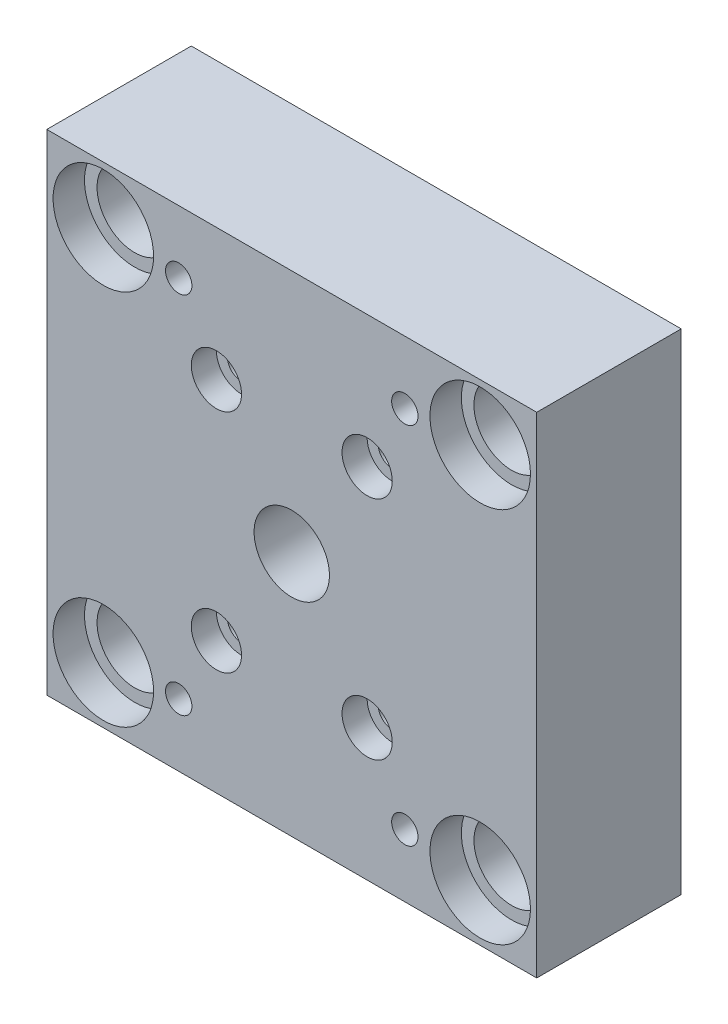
ISO-10303-21;
HEADER;
FILE_DESCRIPTION(('STEP AP214'),'2;1');
FILE_NAME('part.step','',(''),(''),'','','');
FILE_SCHEMA(('AUTOMOTIVE_DESIGN { 1 0 10303 214 1 1 1 1 }'));
ENDSEC;
DATA;
#1=APPLICATION_CONTEXT('core data for automotive mechanical design processes');
#2=APPLICATION_PROTOCOL_DEFINITION('international standard','automotive_design',2000,#1);
#3=PRODUCT_CONTEXT('',#1,'mechanical');
#4=PRODUCT('Part','Part','',(#3));
#5=PRODUCT_RELATED_PRODUCT_CATEGORY('part','',(#4));
#6=PRODUCT_DEFINITION_FORMATION('','',#4);
#7=PRODUCT_DEFINITION_CONTEXT('part definition',#1,'design');
#8=PRODUCT_DEFINITION('design','',#6,#7);
#9=PRODUCT_DEFINITION_SHAPE('','',#8);
#10=(LENGTH_UNIT() NAMED_UNIT(*) SI_UNIT(.MILLI.,.METRE.));
#11=(NAMED_UNIT(*) PLANE_ANGLE_UNIT() SI_UNIT($,.RADIAN.));
#12=(NAMED_UNIT(*) SI_UNIT($,.STERADIAN.) SOLID_ANGLE_UNIT());
#13=UNCERTAINTY_MEASURE_WITH_UNIT(LENGTH_MEASURE(1.E-05),#10,'distance_accuracy_value','');
#14=(GEOMETRIC_REPRESENTATION_CONTEXT(3) GLOBAL_UNCERTAINTY_ASSIGNED_CONTEXT((#13)) GLOBAL_UNIT_ASSIGNED_CONTEXT((#10,
#11,#12)) REPRESENTATION_CONTEXT('',''));
#15=CARTESIAN_POINT('',(0.,0.,0.));
#16=DIRECTION('',(0.,0.,1.));
#17=DIRECTION('',(1.,0.,0.));
#18=AXIS2_PLACEMENT_3D('',#15,#16,#17);
#19=CARTESIAN_POINT('',(30.,-30.,0.));
#20=DIRECTION('',(0.,0.,1.));
#21=DIRECTION('',(1.,0.,0.));
#22=AXIS2_PLACEMENT_3D('',#19,#20,#21);
#23=CYLINDRICAL_SURFACE('',#22,6.);
#24=CARTESIAN_POINT('',(30.,-30.,0.));
#25=DIRECTION('',(0.,0.,1.));
#26=DIRECTION('',(1.,0.,0.));
#27=AXIS2_PLACEMENT_3D('',#24,#25,#26);
#28=CIRCLE('',#27,6.);
#29=CARTESIAN_POINT('',(36.,-30.,0.));
#30=VERTEX_POINT('',#29);
#31=EDGE_CURVE('E283',#30,#30,#28,.T.);
#32=ORIENTED_EDGE('',*,*,#31,.F.);
#33=EDGE_LOOP('',(#32));
#34=FACE_BOUND('',#33,.T.);
#35=CARTESIAN_POINT('',(30.,-30.,18.));
#36=DIRECTION('',(0.,0.,1.));
#37=DIRECTION('',(1.,0.,0.));
#38=AXIS2_PLACEMENT_3D('',#35,#36,#37);
#39=CIRCLE('',#38,6.);
#40=CARTESIAN_POINT('',(36.,-30.,18.));
#41=VERTEX_POINT('',#40);
#42=EDGE_CURVE('E256',#41,#41,#39,.F.);
#43=ORIENTED_EDGE('',*,*,#42,.F.);
#44=EDGE_LOOP('',(#43));
#45=FACE_BOUND('',#44,.T.);
#46=ADVANCED_FACE('F37',(#34,#45),#23,.F.);
#47=CARTESIAN_POINT('',(-30.,-30.,0.));
#48=DIRECTION('',(0.,0.,1.));
#49=DIRECTION('',(1.,0.,0.));
#50=AXIS2_PLACEMENT_3D('',#47,#48,#49);
#51=CYLINDRICAL_SURFACE('',#50,6.);
#52=CARTESIAN_POINT('',(-30.,-30.,0.));
#53=DIRECTION('',(0.,0.,1.));
#54=DIRECTION('',(1.,0.,0.));
#55=AXIS2_PLACEMENT_3D('',#52,#53,#54);
#56=CIRCLE('',#55,6.);
#57=CARTESIAN_POINT('',(-24.,-30.,0.));
#58=VERTEX_POINT('',#57);
#59=EDGE_CURVE('E280',#58,#58,#56,.T.);
#60=ORIENTED_EDGE('',*,*,#59,.F.);
#61=EDGE_LOOP('',(#60));
#62=FACE_BOUND('',#61,.T.);
#63=CARTESIAN_POINT('',(-30.,-30.,18.));
#64=DIRECTION('',(0.,0.,1.));
#65=DIRECTION('',(1.,0.,0.));
#66=AXIS2_PLACEMENT_3D('',#63,#64,#65);
#67=CIRCLE('',#66,6.);
#68=CARTESIAN_POINT('',(-24.,-30.,18.));
#69=VERTEX_POINT('',#68);
#70=EDGE_CURVE('E262',#69,#69,#67,.F.);
#71=ORIENTED_EDGE('',*,*,#70,.F.);
#72=EDGE_LOOP('',(#71));
#73=FACE_BOUND('',#72,.T.);
#74=ADVANCED_FACE('F409',(#62,#73),#51,.F.);
#75=CARTESIAN_POINT('',(-30.,30.,0.));
#76=DIRECTION('',(0.,0.,1.));
#77=DIRECTION('',(1.,0.,0.));
#78=AXIS2_PLACEMENT_3D('',#75,#76,#77);
#79=CYLINDRICAL_SURFACE('',#78,6.);
#80=CARTESIAN_POINT('',(-30.,30.,0.));
#81=DIRECTION('',(0.,0.,1.));
#82=DIRECTION('',(1.,0.,0.));
#83=AXIS2_PLACEMENT_3D('',#80,#81,#82);
#84=CIRCLE('',#83,6.);
#85=CARTESIAN_POINT('',(-24.,30.,0.));
#86=VERTEX_POINT('',#85);
#87=EDGE_CURVE('E289',#86,#86,#84,.T.);
#88=ORIENTED_EDGE('',*,*,#87,.F.);
#89=EDGE_LOOP('',(#88));
#90=FACE_BOUND('',#89,.T.);
#91=CARTESIAN_POINT('',(-30.,30.,18.));
#92=DIRECTION('',(0.,0.,1.));
#93=DIRECTION('',(1.,0.,0.));
#94=AXIS2_PLACEMENT_3D('',#91,#92,#93);
#95=CIRCLE('',#94,6.);
#96=CARTESIAN_POINT('',(-24.,30.,18.));
#97=VERTEX_POINT('',#96);
#98=EDGE_CURVE('E269',#97,#97,#95,.F.);
#99=ORIENTED_EDGE('',*,*,#98,.F.);
#100=EDGE_LOOP('',(#99));
#101=FACE_BOUND('',#100,.T.);
#102=ADVANCED_FACE('F415',(#90,#101),#79,.F.);
#103=CARTESIAN_POINT('',(30.,30.,0.));
#104=DIRECTION('',(0.,0.,1.));
#105=DIRECTION('',(1.,0.,0.));
#106=AXIS2_PLACEMENT_3D('',#103,#104,#105);
#107=CYLINDRICAL_SURFACE('',#106,6.);
#108=CARTESIAN_POINT('',(30.,30.,0.));
#109=DIRECTION('',(0.,0.,1.));
#110=DIRECTION('',(1.,0.,0.));
#111=AXIS2_PLACEMENT_3D('',#108,#109,#110);
#112=CIRCLE('',#111,6.);
#113=CARTESIAN_POINT('',(36.,30.,0.));
#114=VERTEX_POINT('',#113);
#115=EDGE_CURVE('E286',#114,#114,#112,.T.);
#116=ORIENTED_EDGE('',*,*,#115,.F.);
#117=EDGE_LOOP('',(#116));
#118=FACE_BOUND('',#117,.T.);
#119=CARTESIAN_POINT('',(30.,30.,18.));
#120=DIRECTION('',(0.,0.,1.));
#121=DIRECTION('',(1.,0.,0.));
#122=AXIS2_PLACEMENT_3D('',#119,#120,#121);
#123=CIRCLE('',#122,6.);
#124=CARTESIAN_POINT('',(36.,30.,18.));
#125=VERTEX_POINT('',#124);
#126=EDGE_CURVE('E276',#125,#125,#123,.F.);
#127=ORIENTED_EDGE('',*,*,#126,.F.);
#128=EDGE_LOOP('',(#127));
#129=FACE_BOUND('',#128,.T.);
#130=ADVANCED_FACE('F422',(#118,#129),#107,.F.);
#131=CARTESIAN_POINT('',(-39.,39.,23.));
#132=DIRECTION('',(1.,0.,0.));
#133=DIRECTION('',(0.,1.,0.));
#134=AXIS2_PLACEMENT_3D('',#131,#132,#133);
#135=PLANE('',#134);
#136=DIRECTION('',(0.,-1.,0.));
#137=VECTOR('',#136,1.);
#138=CARTESIAN_POINT('',(-39.,39.,0.));
#139=LINE('',#138,#137);
#140=CARTESIAN_POINT('',(-39.,39.,0.));
#141=VERTEX_POINT('',#140);
#142=CARTESIAN_POINT('',(-39.,-39.,0.));
#143=VERTEX_POINT('',#142);
#144=EDGE_CURVE('E292',#141,#143,#139,.T.);
#145=ORIENTED_EDGE('',*,*,#144,.T.);
#146=DIRECTION('',(0.,0.,-1.));
#147=VECTOR('',#146,1.);
#148=CARTESIAN_POINT('',(-39.,-39.,23.));
#149=LINE('',#148,#147);
#150=CARTESIAN_POINT('',(-39.,-39.,23.));
#151=VERTEX_POINT('',#150);
#152=EDGE_CURVE('E11',#151,#143,#149,.T.);
#153=ORIENTED_EDGE('',*,*,#152,.F.);
#154=DIRECTION('',(0.,-1.,0.));
#155=VECTOR('',#154,1.);
#156=CARTESIAN_POINT('',(-39.,39.,23.));
#157=LINE('',#156,#155);
#158=CARTESIAN_POINT('',(-39.,39.,23.));
#159=VERTEX_POINT('',#158);
#160=EDGE_CURVE('E293',#159,#151,#157,.T.);
#161=ORIENTED_EDGE('',*,*,#160,.F.);
#162=DIRECTION('',(0.,0.,-1.));
#163=VECTOR('',#162,1.);
#164=CARTESIAN_POINT('',(-39.,39.,23.));
#165=LINE('',#164,#163);
#166=EDGE_CURVE('E299',#159,#141,#165,.T.);
#167=ORIENTED_EDGE('',*,*,#166,.T.);
#168=EDGE_LOOP('',(#145,#153,#161,#167));
#169=FACE_BOUND('',#168,.T.);
#170=ADVANCED_FACE('F39',(#169),#135,.F.);
#171=CARTESIAN_POINT('',(-39.,-39.,23.));
#172=DIRECTION('',(0.,1.,0.));
#173=DIRECTION('',(-1.,0.,0.));
#174=AXIS2_PLACEMENT_3D('',#171,#172,#173);
#175=PLANE('',#174);
#176=DIRECTION('',(1.,0.,0.));
#177=VECTOR('',#176,1.);
#178=CARTESIAN_POINT('',(-39.,-39.,0.));
#179=LINE('',#178,#177);
#180=CARTESIAN_POINT('',(39.,-39.,0.));
#181=VERTEX_POINT('',#180);
#182=EDGE_CURVE('E302',#143,#181,#179,.T.);
#183=ORIENTED_EDGE('',*,*,#182,.T.);
#184=DIRECTION('',(0.,0.,-1.));
#185=VECTOR('',#184,1.);
#186=CARTESIAN_POINT('',(39.,-39.,23.));
#187=LINE('',#186,#185);
#188=CARTESIAN_POINT('',(39.,-39.,23.));
#189=VERTEX_POINT('',#188);
#190=EDGE_CURVE('E46',#189,#181,#187,.T.);
#191=ORIENTED_EDGE('',*,*,#190,.F.);
#192=DIRECTION('',(1.,0.,0.));
#193=VECTOR('',#192,1.);
#194=CARTESIAN_POINT('',(-39.,-39.,23.));
#195=LINE('',#194,#193);
#196=EDGE_CURVE('E91',#151,#189,#195,.T.);
#197=ORIENTED_EDGE('',*,*,#196,.F.);
#198=ORIENTED_EDGE('',*,*,#152,.T.);
#199=EDGE_LOOP('',(#183,#191,#197,#198));
#200=FACE_BOUND('',#199,.T.);
#201=ADVANCED_FACE('F389',(#200),#175,.F.);
#202=CARTESIAN_POINT('',(39.,39.,23.));
#203=DIRECTION('',(-1.,0.,0.));
#204=DIRECTION('',(0.,-1.,0.));
#205=AXIS2_PLACEMENT_3D('',#202,#203,#204);
#206=PLANE('',#205);
#207=DIRECTION('',(0.,1.,0.));
#208=VECTOR('',#207,1.);
#209=CARTESIAN_POINT('',(39.,39.,0.));
#210=LINE('',#209,#208);
#211=CARTESIAN_POINT('',(39.,39.,0.));
#212=VERTEX_POINT('',#211);
#213=EDGE_CURVE('E304',#181,#212,#210,.T.);
#214=ORIENTED_EDGE('',*,*,#213,.T.);
#215=DIRECTION('',(0.,0.,-1.));
#216=VECTOR('',#215,1.);
#217=CARTESIAN_POINT('',(39.,39.,23.));
#218=LINE('',#217,#216);
#219=CARTESIAN_POINT('',(39.,39.,23.));
#220=VERTEX_POINT('',#219);
#221=EDGE_CURVE('E308',#220,#212,#218,.T.);
#222=ORIENTED_EDGE('',*,*,#221,.F.);
#223=DIRECTION('',(0.,1.,0.));
#224=VECTOR('',#223,1.);
#225=CARTESIAN_POINT('',(39.,39.,23.));
#226=LINE('',#225,#224);
#227=EDGE_CURVE('E296',#189,#220,#226,.T.);
#228=ORIENTED_EDGE('',*,*,#227,.F.);
#229=ORIENTED_EDGE('',*,*,#190,.T.);
#230=EDGE_LOOP('',(#214,#222,#228,#229));
#231=FACE_BOUND('',#230,.T.);
#232=ADVANCED_FACE('F394',(#231),#206,.F.);
#233=CARTESIAN_POINT('',(-39.,39.,23.));
#234=DIRECTION('',(0.,-1.,0.));
#235=DIRECTION('',(1.,0.,0.));
#236=AXIS2_PLACEMENT_3D('',#233,#234,#235);
#237=PLANE('',#236);
#238=DIRECTION('',(-1.,0.,0.));
#239=VECTOR('',#238,1.);
#240=CARTESIAN_POINT('',(-39.,39.,0.));
#241=LINE('',#240,#239);
#242=EDGE_CURVE('E84',#212,#141,#241,.T.);
#243=ORIENTED_EDGE('',*,*,#242,.T.);
#244=ORIENTED_EDGE('',*,*,#166,.F.);
#245=DIRECTION('',(-1.,0.,0.));
#246=VECTOR('',#245,1.);
#247=CARTESIAN_POINT('',(-39.,39.,23.));
#248=LINE('',#247,#246);
#249=EDGE_CURVE('E63',#220,#159,#248,.T.);
#250=ORIENTED_EDGE('',*,*,#249,.F.);
#251=ORIENTED_EDGE('',*,*,#221,.T.);
#252=EDGE_LOOP('',(#243,#244,#250,#251));
#253=FACE_BOUND('',#252,.T.);
#254=ADVANCED_FACE('F365',(#253),#237,.F.);
#255=CARTESIAN_POINT('',(-39.,-39.,23.));
#256=DIRECTION('',(0.,0.,1.));
#257=DIRECTION('',(1.,0.,0.));
#258=AXIS2_PLACEMENT_3D('',#255,#256,#257);
#259=PLANE('',#258);
#260=CARTESIAN_POINT('',(12.,18.,23.));
#261=DIRECTION('',(0.,0.,1.));
#262=DIRECTION('',(1.,0.,0.));
#263=AXIS2_PLACEMENT_3D('',#260,#261,#262);
#264=CIRCLE('',#263,3.99999999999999);
#265=CARTESIAN_POINT('',(16.,18.,23.));
#266=VERTEX_POINT('',#265);
#267=EDGE_CURVE('E584',#266,#266,#264,.T.);
#268=ORIENTED_EDGE('',*,*,#267,.F.);
#269=EDGE_LOOP('',(#268));
#270=FACE_BOUND('',#269,.T.);
#271=CARTESIAN_POINT('',(-12.,18.,23.));
#272=DIRECTION('',(0.,0.,1.));
#273=DIRECTION('',(1.,0.,0.));
#274=AXIS2_PLACEMENT_3D('',#271,#272,#273);
#275=CIRCLE('',#274,3.99999999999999);
#276=CARTESIAN_POINT('',(-8.00000000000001,18.,23.));
#277=VERTEX_POINT('',#276);
#278=EDGE_CURVE('E331',#277,#277,#275,.T.);
#279=ORIENTED_EDGE('',*,*,#278,.F.);
#280=EDGE_LOOP('',(#279));
#281=FACE_BOUND('',#280,.T.);
#282=CARTESIAN_POINT('',(-12.,-18.,23.));
#283=DIRECTION('',(0.,0.,1.));
#284=DIRECTION('',(1.,0.,0.));
#285=AXIS2_PLACEMENT_3D('',#282,#283,#284);
#286=CIRCLE('',#285,3.99999999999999);
#287=CARTESIAN_POINT('',(-8.,-18.,23.));
#288=VERTEX_POINT('',#287);
#289=EDGE_CURVE('E327',#288,#288,#286,.T.);
#290=ORIENTED_EDGE('',*,*,#289,.F.);
#291=EDGE_LOOP('',(#290));
#292=FACE_BOUND('',#291,.T.);
#293=CARTESIAN_POINT('',(12.,-18.,23.));
#294=DIRECTION('',(0.,0.,1.));
#295=DIRECTION('',(1.,0.,0.));
#296=AXIS2_PLACEMENT_3D('',#293,#294,#295);
#297=CIRCLE('',#296,3.99999999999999);
#298=CARTESIAN_POINT('',(16.,-18.,23.));
#299=VERTEX_POINT('',#298);
#300=EDGE_CURVE('E177',#299,#299,#297,.T.);
#301=ORIENTED_EDGE('',*,*,#300,.F.);
#302=EDGE_LOOP('',(#301));
#303=FACE_BOUND('',#302,.T.);
#304=CARTESIAN_POINT('',(0.,0.,23.));
#305=DIRECTION('',(0.,0.,1.));
#306=DIRECTION('',(1.,0.,0.));
#307=AXIS2_PLACEMENT_3D('',#304,#305,#306);
#308=CIRCLE('',#307,6.);
#309=CARTESIAN_POINT('',(6.,0.,23.));
#310=VERTEX_POINT('',#309);
#311=EDGE_CURVE('E225',#310,#310,#308,.T.);
#312=ORIENTED_EDGE('',*,*,#311,.F.);
#313=EDGE_LOOP('',(#312));
#314=FACE_BOUND('',#313,.T.);
#315=CARTESIAN_POINT('',(18.,29.,23.));
#316=DIRECTION('',(0.,0.,1.));
#317=DIRECTION('',(1.,0.,0.));
#318=AXIS2_PLACEMENT_3D('',#315,#316,#317);
#319=CIRCLE('',#318,2.1);
#320=CARTESIAN_POINT('',(20.1,29.,23.));
#321=VERTEX_POINT('',#320);
#322=EDGE_CURVE('E231',#321,#321,#319,.T.);
#323=ORIENTED_EDGE('',*,*,#322,.F.);
#324=EDGE_LOOP('',(#323));
#325=FACE_BOUND('',#324,.T.);
#326=CARTESIAN_POINT('',(-18.,29.,23.));
#327=DIRECTION('',(0.,0.,1.));
#328=DIRECTION('',(1.,0.,0.));
#329=AXIS2_PLACEMENT_3D('',#326,#327,#328);
#330=CIRCLE('',#329,2.1);
#331=CARTESIAN_POINT('',(-15.9,29.,23.));
#332=VERTEX_POINT('',#331);
#333=EDGE_CURVE('E237',#332,#332,#330,.T.);
#334=ORIENTED_EDGE('',*,*,#333,.F.);
#335=EDGE_LOOP('',(#334));
#336=FACE_BOUND('',#335,.T.);
#337=CARTESIAN_POINT('',(-18.,-29.,23.));
#338=DIRECTION('',(0.,0.,1.));
#339=DIRECTION('',(1.,0.,0.));
#340=AXIS2_PLACEMENT_3D('',#337,#338,#339);
#341=CIRCLE('',#340,2.1);
#342=CARTESIAN_POINT('',(-15.9,-29.,23.));
#343=VERTEX_POINT('',#342);
#344=EDGE_CURVE('E243',#343,#343,#341,.T.);
#345=ORIENTED_EDGE('',*,*,#344,.F.);
#346=EDGE_LOOP('',(#345));
#347=FACE_BOUND('',#346,.T.);
#348=CARTESIAN_POINT('',(18.,-29.,23.));
#349=DIRECTION('',(0.,0.,1.));
#350=DIRECTION('',(1.,0.,0.));
#351=AXIS2_PLACEMENT_3D('',#348,#349,#350);
#352=CIRCLE('',#351,2.1);
#353=CARTESIAN_POINT('',(20.1,-29.,23.));
#354=VERTEX_POINT('',#353);
#355=EDGE_CURVE('E249',#354,#354,#352,.T.);
#356=ORIENTED_EDGE('',*,*,#355,.F.);
#357=EDGE_LOOP('',(#356));
#358=FACE_BOUND('',#357,.T.);
#359=CARTESIAN_POINT('',(30.,-30.,23.));
#360=DIRECTION('',(0.,0.,1.));
#361=DIRECTION('',(1.,0.,0.));
#362=AXIS2_PLACEMENT_3D('',#359,#360,#361);
#363=CIRCLE('',#362,8.);
#364=CARTESIAN_POINT('',(38.,-30.,23.));
#365=VERTEX_POINT('',#364);
#366=EDGE_CURVE('E252',#365,#365,#363,.T.);
#367=ORIENTED_EDGE('',*,*,#366,.F.);
#368=EDGE_LOOP('',(#367));
#369=FACE_BOUND('',#368,.T.);
#370=CARTESIAN_POINT('',(-30.,-30.,23.));
#371=DIRECTION('',(0.,0.,1.));
#372=DIRECTION('',(1.,0.,0.));
#373=AXIS2_PLACEMENT_3D('',#370,#371,#372);
#374=CIRCLE('',#373,8.);
#375=CARTESIAN_POINT('',(-22.,-30.,23.));
#376=VERTEX_POINT('',#375);
#377=EDGE_CURVE('E263',#376,#376,#374,.T.);
#378=ORIENTED_EDGE('',*,*,#377,.F.);
#379=EDGE_LOOP('',(#378));
#380=FACE_BOUND('',#379,.T.);
#381=CARTESIAN_POINT('',(-30.,30.,23.));
#382=DIRECTION('',(0.,0.,1.));
#383=DIRECTION('',(1.,0.,0.));
#384=AXIS2_PLACEMENT_3D('',#381,#382,#383);
#385=CIRCLE('',#384,8.);
#386=CARTESIAN_POINT('',(-22.,30.,23.));
#387=VERTEX_POINT('',#386);
#388=EDGE_CURVE('E270',#387,#387,#385,.T.);
#389=ORIENTED_EDGE('',*,*,#388,.F.);
#390=EDGE_LOOP('',(#389));
#391=FACE_BOUND('',#390,.T.);
#392=CARTESIAN_POINT('',(30.,30.,23.));
#393=DIRECTION('',(0.,0.,1.));
#394=DIRECTION('',(1.,0.,0.));
#395=AXIS2_PLACEMENT_3D('',#392,#393,#394);
#396=CIRCLE('',#395,8.);
#397=CARTESIAN_POINT('',(38.,30.,23.));
#398=VERTEX_POINT('',#397);
#399=EDGE_CURVE('E277',#398,#398,#396,.T.);
#400=ORIENTED_EDGE('',*,*,#399,.F.);
#401=EDGE_LOOP('',(#400));
#402=FACE_BOUND('',#401,.T.);
#403=ORIENTED_EDGE('',*,*,#160,.T.);
#404=ORIENTED_EDGE('',*,*,#196,.T.);
#405=ORIENTED_EDGE('',*,*,#227,.T.);
#406=ORIENTED_EDGE('',*,*,#249,.T.);
#407=EDGE_LOOP('',(#403,#404,#405,#406));
#408=FACE_BOUND('',#407,.T.);
#409=ADVANCED_FACE('F361',(#270,#281,#292,#303,#314,#325,#336,#347,#358,#369,#380,#391,#402,
#408),#259,.T.);
#410=CARTESIAN_POINT('',(-39.,-39.,0.));
#411=DIRECTION('',(0.,0.,1.));
#412=DIRECTION('',(1.,0.,0.));
#413=AXIS2_PLACEMENT_3D('',#410,#411,#412);
#414=PLANE('',#413);
#415=DIRECTION('',(1.,0.,0.));
#416=VECTOR('',#415,1.);
#417=CARTESIAN_POINT('',(12.,24.,0.));
#418=LINE('',#417,#416);
#419=CARTESIAN_POINT('',(-11.9999999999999,24.,0.));
#420=VERTEX_POINT('',#419);
#421=CARTESIAN_POINT('',(12.,24.,0.));
#422=VERTEX_POINT('',#421);
#423=EDGE_CURVE('E194',#420,#422,#418,.T.);
#424=ORIENTED_EDGE('',*,*,#423,.F.);
#425=CARTESIAN_POINT('',(-12.,18.,0.));
#426=DIRECTION('',(0.,0.,-1.));
#427=DIRECTION('',(0.,-1.,0.));
#428=AXIS2_PLACEMENT_3D('',#425,#426,#427);
#429=CIRCLE('',#428,6.);
#430=CARTESIAN_POINT('',(-18.,18.,0.));
#431=VERTEX_POINT('',#430);
#432=EDGE_CURVE('E54',#431,#420,#429,.T.);
#433=ORIENTED_EDGE('',*,*,#432,.F.);
#434=DIRECTION('',(0.,1.,0.));
#435=VECTOR('',#434,1.);
#436=CARTESIAN_POINT('',(-18.,18.,0.));
#437=LINE('',#436,#435);
#438=CARTESIAN_POINT('',(-18.,-18.,0.));
#439=VERTEX_POINT('',#438);
#440=EDGE_CURVE('E171',#439,#431,#437,.T.);
#441=ORIENTED_EDGE('',*,*,#440,.F.);
#442=CARTESIAN_POINT('',(-12.,-18.,0.));
#443=DIRECTION('',(0.,0.,-1.));
#444=DIRECTION('',(0.,1.,0.));
#445=AXIS2_PLACEMENT_3D('',#442,#443,#444);
#446=CIRCLE('',#445,6.);
#447=CARTESIAN_POINT('',(-12.,-24.,0.));
#448=VERTEX_POINT('',#447);
#449=EDGE_CURVE('E174',#448,#439,#446,.T.);
#450=ORIENTED_EDGE('',*,*,#449,.F.);
#451=DIRECTION('',(-1.,0.,0.));
#452=VECTOR('',#451,1.);
#453=CARTESIAN_POINT('',(12.,-24.,0.));
#454=LINE('',#453,#452);
#455=CARTESIAN_POINT('',(12.,-24.,0.));
#456=VERTEX_POINT('',#455);
#457=EDGE_CURVE('E206',#456,#448,#454,.T.);
#458=ORIENTED_EDGE('',*,*,#457,.F.);
#459=CARTESIAN_POINT('',(12.,-18.,0.));
#460=DIRECTION('',(0.,0.,-1.));
#461=DIRECTION('',(0.,1.,0.));
#462=AXIS2_PLACEMENT_3D('',#459,#460,#461);
#463=CIRCLE('',#462,6.);
#464=CARTESIAN_POINT('',(18.,-18.,0.));
#465=VERTEX_POINT('',#464);
#466=EDGE_CURVE('E203',#465,#456,#463,.T.);
#467=ORIENTED_EDGE('',*,*,#466,.F.);
#468=DIRECTION('',(0.,-1.,0.));
#469=VECTOR('',#468,1.);
#470=CARTESIAN_POINT('',(18.,18.,0.));
#471=LINE('',#470,#469);
#472=CARTESIAN_POINT('',(18.,18.,0.));
#473=VERTEX_POINT('',#472);
#474=EDGE_CURVE('E200',#473,#465,#471,.T.);
#475=ORIENTED_EDGE('',*,*,#474,.F.);
#476=CARTESIAN_POINT('',(12.,18.,0.));
#477=DIRECTION('',(0.,0.,-1.));
#478=DIRECTION('',(0.,1.,0.));
#479=AXIS2_PLACEMENT_3D('',#476,#477,#478);
#480=CIRCLE('',#479,6.);
#481=EDGE_CURVE('E197',#422,#473,#480,.T.);
#482=ORIENTED_EDGE('',*,*,#481,.F.);
#483=EDGE_LOOP('',(#424,#433,#441,#450,#458,#467,#475,#482));
#484=FACE_BOUND('',#483,.T.);
#485=ORIENTED_EDGE('',*,*,#59,.T.);
#486=EDGE_LOOP('',(#485));
#487=FACE_BOUND('',#486,.T.);
#488=ORIENTED_EDGE('',*,*,#31,.T.);
#489=EDGE_LOOP('',(#488));
#490=FACE_BOUND('',#489,.T.);
#491=ORIENTED_EDGE('',*,*,#115,.T.);
#492=EDGE_LOOP('',(#491));
#493=FACE_BOUND('',#492,.T.);
#494=ORIENTED_EDGE('',*,*,#87,.T.);
#495=EDGE_LOOP('',(#494));
#496=FACE_BOUND('',#495,.T.);
#497=ORIENTED_EDGE('',*,*,#144,.F.);
#498=ORIENTED_EDGE('',*,*,#242,.F.);
#499=ORIENTED_EDGE('',*,*,#213,.F.);
#500=ORIENTED_EDGE('',*,*,#182,.F.);
#501=EDGE_LOOP('',(#497,#498,#499,#500));
#502=FACE_BOUND('',#501,.T.);
#503=ADVANCED_FACE('F364',(#484,#487,#490,#493,#496,#502),#414,.F.);
#504=CARTESIAN_POINT('',(30.,30.,18.));
#505=DIRECTION('',(0.,0.,1.));
#506=DIRECTION('',(1.,0.,0.));
#507=AXIS2_PLACEMENT_3D('',#504,#505,#506);
#508=PLANE('',#507);
#509=CARTESIAN_POINT('',(30.,30.,18.));
#510=DIRECTION('',(0.,0.,1.));
#511=DIRECTION('',(1.,0.,0.));
#512=AXIS2_PLACEMENT_3D('',#509,#510,#511);
#513=CIRCLE('',#512,8.);
#514=CARTESIAN_POINT('',(38.,30.,18.));
#515=VERTEX_POINT('',#514);
#516=EDGE_CURVE('E273',#515,#515,#513,.T.);
#517=ORIENTED_EDGE('',*,*,#516,.T.);
#518=EDGE_LOOP('',(#517));
#519=FACE_BOUND('',#518,.T.);
#520=ORIENTED_EDGE('',*,*,#126,.T.);
#521=EDGE_LOOP('',(#520));
#522=FACE_BOUND('',#521,.T.);
#523=ADVANCED_FACE('F397',(#519,#522),#508,.T.);
#524=CARTESIAN_POINT('',(30.,30.,18.));
#525=DIRECTION('',(0.,0.,1.));
#526=DIRECTION('',(1.,0.,0.));
#527=AXIS2_PLACEMENT_3D('',#524,#525,#526);
#528=CYLINDRICAL_SURFACE('',#527,8.);
#529=ORIENTED_EDGE('',*,*,#516,.F.);
#530=EDGE_LOOP('',(#529));
#531=FACE_BOUND('',#530,.T.);
#532=ORIENTED_EDGE('',*,*,#399,.T.);
#533=EDGE_LOOP('',(#532));
#534=FACE_BOUND('',#533,.T.);
#535=ADVANCED_FACE('F403',(#531,#534),#528,.F.);
#536=CARTESIAN_POINT('',(-30.,30.,18.));
#537=DIRECTION('',(0.,0.,1.));
#538=DIRECTION('',(1.,0.,0.));
#539=AXIS2_PLACEMENT_3D('',#536,#537,#538);
#540=PLANE('',#539);
#541=CARTESIAN_POINT('',(-30.,30.,18.));
#542=DIRECTION('',(0.,0.,1.));
#543=DIRECTION('',(1.,0.,0.));
#544=AXIS2_PLACEMENT_3D('',#541,#542,#543);
#545=CIRCLE('',#544,8.);
#546=CARTESIAN_POINT('',(-22.,30.,18.));
#547=VERTEX_POINT('',#546);
#548=EDGE_CURVE('E266',#547,#547,#545,.T.);
#549=ORIENTED_EDGE('',*,*,#548,.T.);
#550=EDGE_LOOP('',(#549));
#551=FACE_BOUND('',#550,.T.);
#552=ORIENTED_EDGE('',*,*,#98,.T.);
#553=EDGE_LOOP('',(#552));
#554=FACE_BOUND('',#553,.T.);
#555=ADVANCED_FACE('F434',(#551,#554),#540,.T.);
#556=CARTESIAN_POINT('',(-30.,30.,18.));
#557=DIRECTION('',(0.,0.,1.));
#558=DIRECTION('',(1.,0.,0.));
#559=AXIS2_PLACEMENT_3D('',#556,#557,#558);
#560=CYLINDRICAL_SURFACE('',#559,8.);
#561=ORIENTED_EDGE('',*,*,#548,.F.);
#562=EDGE_LOOP('',(#561));
#563=FACE_BOUND('',#562,.T.);
#564=ORIENTED_EDGE('',*,*,#388,.T.);
#565=EDGE_LOOP('',(#564));
#566=FACE_BOUND('',#565,.T.);
#567=ADVANCED_FACE('F436',(#563,#566),#560,.F.);
#568=CARTESIAN_POINT('',(-30.,-30.,18.));
#569=DIRECTION('',(0.,0.,1.));
#570=DIRECTION('',(1.,0.,0.));
#571=AXIS2_PLACEMENT_3D('',#568,#569,#570);
#572=PLANE('',#571);
#573=CARTESIAN_POINT('',(-30.,-30.,18.));
#574=DIRECTION('',(0.,0.,1.));
#575=DIRECTION('',(1.,0.,0.));
#576=AXIS2_PLACEMENT_3D('',#573,#574,#575);
#577=CIRCLE('',#576,8.);
#578=CARTESIAN_POINT('',(-22.,-30.,18.));
#579=VERTEX_POINT('',#578);
#580=EDGE_CURVE('E259',#579,#579,#577,.T.);
#581=ORIENTED_EDGE('',*,*,#580,.T.);
#582=EDGE_LOOP('',(#581));
#583=FACE_BOUND('',#582,.T.);
#584=ORIENTED_EDGE('',*,*,#70,.T.);
#585=EDGE_LOOP('',(#584));
#586=FACE_BOUND('',#585,.T.);
#587=ADVANCED_FACE('F443',(#583,#586),#572,.T.);
#588=CARTESIAN_POINT('',(-30.,-30.,18.));
#589=DIRECTION('',(0.,0.,1.));
#590=DIRECTION('',(1.,0.,0.));
#591=AXIS2_PLACEMENT_3D('',#588,#589,#590);
#592=CYLINDRICAL_SURFACE('',#591,8.);
#593=ORIENTED_EDGE('',*,*,#580,.F.);
#594=EDGE_LOOP('',(#593));
#595=FACE_BOUND('',#594,.T.);
#596=ORIENTED_EDGE('',*,*,#377,.T.);
#597=EDGE_LOOP('',(#596));
#598=FACE_BOUND('',#597,.T.);
#599=ADVANCED_FACE('F448',(#595,#598),#592,.F.);
#600=CARTESIAN_POINT('',(30.,-30.,18.));
#601=DIRECTION('',(0.,0.,1.));
#602=DIRECTION('',(1.,0.,0.));
#603=AXIS2_PLACEMENT_3D('',#600,#601,#602);
#604=PLANE('',#603);
#605=CARTESIAN_POINT('',(30.,-30.,18.));
#606=DIRECTION('',(0.,0.,1.));
#607=DIRECTION('',(1.,0.,0.));
#608=AXIS2_PLACEMENT_3D('',#605,#606,#607);
#609=CIRCLE('',#608,8.);
#610=CARTESIAN_POINT('',(38.,-30.,18.));
#611=VERTEX_POINT('',#610);
#612=EDGE_CURVE('E253',#611,#611,#609,.T.);
#613=ORIENTED_EDGE('',*,*,#612,.T.);
#614=EDGE_LOOP('',(#613));
#615=FACE_BOUND('',#614,.T.);
#616=ORIENTED_EDGE('',*,*,#42,.T.);
#617=EDGE_LOOP('',(#616));
#618=FACE_BOUND('',#617,.T.);
#619=ADVANCED_FACE('F451',(#615,#618),#604,.T.);
#620=CARTESIAN_POINT('',(30.,-30.,18.));
#621=DIRECTION('',(0.,0.,1.));
#622=DIRECTION('',(1.,0.,0.));
#623=AXIS2_PLACEMENT_3D('',#620,#621,#622);
#624=CYLINDRICAL_SURFACE('',#623,8.);
#625=ORIENTED_EDGE('',*,*,#612,.F.);
#626=EDGE_LOOP('',(#625));
#627=FACE_BOUND('',#626,.T.);
#628=ORIENTED_EDGE('',*,*,#366,.T.);
#629=EDGE_LOOP('',(#628));
#630=FACE_BOUND('',#629,.T.);
#631=ADVANCED_FACE('F456',(#627,#630),#624,.F.);
#632=CARTESIAN_POINT('',(18.,-29.,23.));
#633=DIRECTION('',(0.,0.,1.));
#634=DIRECTION('',(1.,0.,0.));
#635=AXIS2_PLACEMENT_3D('',#632,#633,#634);
#636=CYLINDRICAL_SURFACE('',#635,2.1);
#637=CARTESIAN_POINT('',(18.,-29.,9.));
#638=DIRECTION('',(0.,0.,1.));
#639=DIRECTION('',(1.,0.,0.));
#640=AXIS2_PLACEMENT_3D('',#637,#638,#639);
#641=CIRCLE('',#640,2.1);
#642=CARTESIAN_POINT('',(20.1,-29.,9.));
#643=VERTEX_POINT('',#642);
#644=EDGE_CURVE('E246',#643,#643,#641,.T.);
#645=ORIENTED_EDGE('',*,*,#644,.F.);
#646=EDGE_LOOP('',(#645));
#647=FACE_BOUND('',#646,.T.);
#648=ORIENTED_EDGE('',*,*,#355,.T.);
#649=EDGE_LOOP('',(#648));
#650=FACE_BOUND('',#649,.T.);
#651=ADVANCED_FACE('F459',(#647,#650),#636,.F.);
#652=CARTESIAN_POINT('',(18.,-29.,9.));
#653=DIRECTION('',(0.,0.,1.));
#654=DIRECTION('',(1.,0.,0.));
#655=AXIS2_PLACEMENT_3D('',#652,#653,#654);
#656=CONICAL_SURFACE('',#655,2.1,1.02974425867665);
#657=CARTESIAN_POINT('',(18.,-29.,7.73819270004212));
#658=VERTEX_POINT('',#657);
#659=VERTEX_LOOP('',#658);
#660=FACE_BOUND('',#659,.T.);
#661=ORIENTED_EDGE('',*,*,#644,.T.);
#662=EDGE_LOOP('',(#661));
#663=FACE_BOUND('',#662,.T.);
#664=ADVANCED_FACE('F466',(#660,#663),#656,.F.);
#665=CARTESIAN_POINT('',(-18.,-29.,23.));
#666=DIRECTION('',(0.,0.,1.));
#667=DIRECTION('',(1.,0.,0.));
#668=AXIS2_PLACEMENT_3D('',#665,#666,#667);
#669=CYLINDRICAL_SURFACE('',#668,2.1);
#670=CARTESIAN_POINT('',(-18.,-29.,9.));
#671=DIRECTION('',(0.,0.,1.));
#672=DIRECTION('',(1.,0.,0.));
#673=AXIS2_PLACEMENT_3D('',#670,#671,#672);
#674=CIRCLE('',#673,2.1);
#675=CARTESIAN_POINT('',(-15.9,-29.,9.));
#676=VERTEX_POINT('',#675);
#677=EDGE_CURVE('E240',#676,#676,#674,.T.);
#678=ORIENTED_EDGE('',*,*,#677,.F.);
#679=EDGE_LOOP('',(#678));
#680=FACE_BOUND('',#679,.T.);
#681=ORIENTED_EDGE('',*,*,#344,.T.);
#682=EDGE_LOOP('',(#681));
#683=FACE_BOUND('',#682,.T.);
#684=ADVANCED_FACE('F470',(#680,#683),#669,.F.);
#685=CARTESIAN_POINT('',(-18.,-29.,9.));
#686=DIRECTION('',(0.,0.,1.));
#687=DIRECTION('',(1.,0.,0.));
#688=AXIS2_PLACEMENT_3D('',#685,#686,#687);
#689=CONICAL_SURFACE('',#688,2.1,1.02974425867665);
#690=CARTESIAN_POINT('',(-18.,-29.,7.73819270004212));
#691=VERTEX_POINT('',#690);
#692=VERTEX_LOOP('',#691);
#693=FACE_BOUND('',#692,.T.);
#694=ORIENTED_EDGE('',*,*,#677,.T.);
#695=EDGE_LOOP('',(#694));
#696=FACE_BOUND('',#695,.T.);
#697=ADVANCED_FACE('F474',(#693,#696),#689,.F.);
#698=CARTESIAN_POINT('',(-18.,29.,23.));
#699=DIRECTION('',(0.,0.,1.));
#700=DIRECTION('',(1.,0.,0.));
#701=AXIS2_PLACEMENT_3D('',#698,#699,#700);
#702=CYLINDRICAL_SURFACE('',#701,2.1);
#703=CARTESIAN_POINT('',(-18.,29.,9.));
#704=DIRECTION('',(0.,0.,1.));
#705=DIRECTION('',(1.,0.,0.));
#706=AXIS2_PLACEMENT_3D('',#703,#704,#705);
#707=CIRCLE('',#706,2.1);
#708=CARTESIAN_POINT('',(-15.9,29.,9.));
#709=VERTEX_POINT('',#708);
#710=EDGE_CURVE('E234',#709,#709,#707,.T.);
#711=ORIENTED_EDGE('',*,*,#710,.F.);
#712=EDGE_LOOP('',(#711));
#713=FACE_BOUND('',#712,.T.);
#714=ORIENTED_EDGE('',*,*,#333,.T.);
#715=EDGE_LOOP('',(#714));
#716=FACE_BOUND('',#715,.T.);
#717=ADVANCED_FACE('F478',(#713,#716),#702,.F.);
#718=CARTESIAN_POINT('',(-18.,29.,9.));
#719=DIRECTION('',(0.,0.,1.));
#720=DIRECTION('',(1.,0.,0.));
#721=AXIS2_PLACEMENT_3D('',#718,#719,#720);
#722=CONICAL_SURFACE('',#721,2.1,1.02974425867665);
#723=CARTESIAN_POINT('',(-18.,29.,7.73819270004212));
#724=VERTEX_POINT('',#723);
#725=VERTEX_LOOP('',#724);
#726=FACE_BOUND('',#725,.T.);
#727=ORIENTED_EDGE('',*,*,#710,.T.);
#728=EDGE_LOOP('',(#727));
#729=FACE_BOUND('',#728,.T.);
#730=ADVANCED_FACE('F482',(#726,#729),#722,.F.);
#731=CARTESIAN_POINT('',(18.,29.,23.));
#732=DIRECTION('',(0.,0.,1.));
#733=DIRECTION('',(1.,0.,0.));
#734=AXIS2_PLACEMENT_3D('',#731,#732,#733);
#735=CYLINDRICAL_SURFACE('',#734,2.1);
#736=CARTESIAN_POINT('',(18.,29.,9.));
#737=DIRECTION('',(0.,0.,1.));
#738=DIRECTION('',(1.,0.,0.));
#739=AXIS2_PLACEMENT_3D('',#736,#737,#738);
#740=CIRCLE('',#739,2.1);
#741=CARTESIAN_POINT('',(20.1,29.,9.));
#742=VERTEX_POINT('',#741);
#743=EDGE_CURVE('E228',#742,#742,#740,.T.);
#744=ORIENTED_EDGE('',*,*,#743,.F.);
#745=EDGE_LOOP('',(#744));
#746=FACE_BOUND('',#745,.T.);
#747=ORIENTED_EDGE('',*,*,#322,.T.);
#748=EDGE_LOOP('',(#747));
#749=FACE_BOUND('',#748,.T.);
#750=ADVANCED_FACE('F486',(#746,#749),#735,.F.);
#751=CARTESIAN_POINT('',(18.,29.,9.));
#752=DIRECTION('',(0.,0.,1.));
#753=DIRECTION('',(1.,0.,0.));
#754=AXIS2_PLACEMENT_3D('',#751,#752,#753);
#755=CONICAL_SURFACE('',#754,2.1,1.02974425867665);
#756=CARTESIAN_POINT('',(18.,29.,7.73819270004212));
#757=VERTEX_POINT('',#756);
#758=VERTEX_LOOP('',#757);
#759=FACE_BOUND('',#758,.T.);
#760=ORIENTED_EDGE('',*,*,#743,.T.);
#761=EDGE_LOOP('',(#760));
#762=FACE_BOUND('',#761,.T.);
#763=ADVANCED_FACE('F490',(#759,#762),#755,.F.);
#764=CARTESIAN_POINT('',(0.,0.,0.));
#765=DIRECTION('',(0.,0.,1.));
#766=DIRECTION('',(1.,0.,0.));
#767=AXIS2_PLACEMENT_3D('',#764,#765,#766);
#768=CYLINDRICAL_SURFACE('',#767,6.);
#769=CARTESIAN_POINT('',(0.,0.,12.));
#770=DIRECTION('',(0.,0.,1.));
#771=DIRECTION('',(0.,-1.,0.));
#772=AXIS2_PLACEMENT_3D('',#769,#770,#771);
#773=CIRCLE('',#772,6.);
#774=CARTESIAN_POINT('',(0.,-5.99999999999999,12.));
#775=VERTEX_POINT('',#774);
#776=EDGE_CURVE('E213',#775,#775,#773,.F.);
#777=ORIENTED_EDGE('',*,*,#776,.T.);
#778=EDGE_LOOP('',(#777));
#779=FACE_BOUND('',#778,.T.);
#780=ORIENTED_EDGE('',*,*,#311,.T.);
#781=EDGE_LOOP('',(#780));
#782=FACE_BOUND('',#781,.T.);
#783=ADVANCED_FACE('F494',(#779,#782),#768,.F.);
#784=CARTESIAN_POINT('',(-12.,18.,12.));
#785=DIRECTION('',(0.,0.,1.));
#786=DIRECTION('',(0.,-1.,0.));
#787=AXIS2_PLACEMENT_3D('',#784,#785,#786);
#788=PLANE('',#787);
#789=CARTESIAN_POINT('',(12.,18.,12.));
#790=DIRECTION('',(0.,0.,1.));
#791=DIRECTION('',(0.,-1.,0.));
#792=AXIS2_PLACEMENT_3D('',#789,#790,#791);
#793=CIRCLE('',#792,2.25);
#794=CARTESIAN_POINT('',(12.,15.75,12.));
#795=VERTEX_POINT('',#794);
#796=EDGE_CURVE('E41',#795,#795,#793,.T.);
#797=ORIENTED_EDGE('',*,*,#796,.T.);
#798=EDGE_LOOP('',(#797));
#799=FACE_BOUND('',#798,.T.);
#800=CARTESIAN_POINT('',(-12.,18.,12.));
#801=DIRECTION('',(0.,0.,1.));
#802=DIRECTION('',(0.,-1.,0.));
#803=AXIS2_PLACEMENT_3D('',#800,#801,#802);
#804=CIRCLE('',#803,2.25);
#805=CARTESIAN_POINT('',(-12.,15.75,12.));
#806=VERTEX_POINT('',#805);
#807=EDGE_CURVE('E328',#806,#806,#804,.T.);
#808=ORIENTED_EDGE('',*,*,#807,.T.);
#809=EDGE_LOOP('',(#808));
#810=FACE_BOUND('',#809,.T.);
#811=CARTESIAN_POINT('',(-12.,-18.,12.));
#812=DIRECTION('',(0.,0.,1.));
#813=DIRECTION('',(0.,-1.,0.));
#814=AXIS2_PLACEMENT_3D('',#811,#812,#813);
#815=CIRCLE('',#814,2.25);
#816=CARTESIAN_POINT('',(-12.,-20.25,12.));
#817=VERTEX_POINT('',#816);
#818=EDGE_CURVE('E324',#817,#817,#815,.T.);
#819=ORIENTED_EDGE('',*,*,#818,.T.);
#820=EDGE_LOOP('',(#819));
#821=FACE_BOUND('',#820,.T.);
#822=CARTESIAN_POINT('',(12.,-18.,12.));
#823=DIRECTION('',(0.,0.,1.));
#824=DIRECTION('',(0.,-1.,0.));
#825=AXIS2_PLACEMENT_3D('',#822,#823,#824);
#826=CIRCLE('',#825,2.25);
#827=CARTESIAN_POINT('',(12.,-20.25,12.));
#828=VERTEX_POINT('',#827);
#829=EDGE_CURVE('E195',#828,#828,#826,.T.);
#830=ORIENTED_EDGE('',*,*,#829,.T.);
#831=EDGE_LOOP('',(#830));
#832=FACE_BOUND('',#831,.T.);
#833=CARTESIAN_POINT('',(-12.,18.,12.));
#834=DIRECTION('',(0.,0.,-1.));
#835=DIRECTION('',(0.,-1.,0.));
#836=AXIS2_PLACEMENT_3D('',#833,#834,#835);
#837=CIRCLE('',#836,6.);
#838=CARTESIAN_POINT('',(-18.,18.,12.));
#839=VERTEX_POINT('',#838);
#840=CARTESIAN_POINT('',(-12.,24.,12.));
#841=VERTEX_POINT('',#840);
#842=EDGE_CURVE('E151',#839,#841,#837,.T.);
#843=ORIENTED_EDGE('',*,*,#842,.T.);
#844=DIRECTION('',(1.,0.,0.));
#845=VECTOR('',#844,1.);
#846=CARTESIAN_POINT('',(12.,24.,12.));
#847=LINE('',#846,#845);
#848=CARTESIAN_POINT('',(12.,24.,12.));
#849=VERTEX_POINT('',#848);
#850=EDGE_CURVE('E160',#841,#849,#847,.T.);
#851=ORIENTED_EDGE('',*,*,#850,.T.);
#852=CARTESIAN_POINT('',(12.,18.,12.));
#853=DIRECTION('',(0.,0.,-1.));
#854=DIRECTION('',(0.,1.,0.));
#855=AXIS2_PLACEMENT_3D('',#852,#853,#854);
#856=CIRCLE('',#855,6.);
#857=CARTESIAN_POINT('',(18.,18.,12.));
#858=VERTEX_POINT('',#857);
#859=EDGE_CURVE('E165',#849,#858,#856,.T.);
#860=ORIENTED_EDGE('',*,*,#859,.T.);
#861=DIRECTION('',(0.,-1.,0.));
#862=VECTOR('',#861,1.);
#863=CARTESIAN_POINT('',(18.,18.,12.));
#864=LINE('',#863,#862);
#865=CARTESIAN_POINT('',(18.,-18.,12.));
#866=VERTEX_POINT('',#865);
#867=EDGE_CURVE('E181',#858,#866,#864,.T.);
#868=ORIENTED_EDGE('',*,*,#867,.T.);
#869=CARTESIAN_POINT('',(12.,-18.,12.));
#870=DIRECTION('',(0.,0.,-1.));
#871=DIRECTION('',(0.,1.,0.));
#872=AXIS2_PLACEMENT_3D('',#869,#870,#871);
#873=CIRCLE('',#872,6.);
#874=CARTESIAN_POINT('',(12.,-24.,12.));
#875=VERTEX_POINT('',#874);
#876=EDGE_CURVE('E184',#866,#875,#873,.T.);
#877=ORIENTED_EDGE('',*,*,#876,.T.);
#878=DIRECTION('',(-1.,0.,0.));
#879=VECTOR('',#878,1.);
#880=CARTESIAN_POINT('',(12.,-24.,12.));
#881=LINE('',#880,#879);
#882=CARTESIAN_POINT('',(-12.,-24.,12.));
#883=VERTEX_POINT('',#882);
#884=EDGE_CURVE('E187',#875,#883,#881,.T.);
#885=ORIENTED_EDGE('',*,*,#884,.T.);
#886=CARTESIAN_POINT('',(-12.,-18.,12.));
#887=DIRECTION('',(0.,0.,-1.));
#888=DIRECTION('',(0.,1.,0.));
#889=AXIS2_PLACEMENT_3D('',#886,#887,#888);
#890=CIRCLE('',#889,6.);
#891=CARTESIAN_POINT('',(-18.,-18.,12.));
#892=VERTEX_POINT('',#891);
#893=EDGE_CURVE('E190',#883,#892,#890,.T.);
#894=ORIENTED_EDGE('',*,*,#893,.T.);
#895=DIRECTION('',(0.,1.,0.));
#896=VECTOR('',#895,1.);
#897=CARTESIAN_POINT('',(-18.,18.,12.));
#898=LINE('',#897,#896);
#899=EDGE_CURVE('E157',#892,#839,#898,.T.);
#900=ORIENTED_EDGE('',*,*,#899,.T.);
#901=EDGE_LOOP('',(#843,#851,#860,#868,#877,#885,#894,#900));
#902=FACE_BOUND('',#901,.T.);
#903=ORIENTED_EDGE('',*,*,#776,.F.);
#904=EDGE_LOOP('',(#903));
#905=FACE_BOUND('',#904,.T.);
#906=ADVANCED_FACE('F167',(#799,#810,#821,#832,#902,#905),#788,.F.);
#907=CARTESIAN_POINT('',(-12.,18.,12.));
#908=DIRECTION('',(0.,0.,-1.));
#909=DIRECTION('',(0.,1.,0.));
#910=AXIS2_PLACEMENT_3D('',#907,#908,#909);
#911=CYLINDRICAL_SURFACE('',#910,6.);
#912=ORIENTED_EDGE('',*,*,#432,.T.);
#913=DIRECTION('',(0.,0.,-1.));
#914=VECTOR('',#913,1.);
#915=CARTESIAN_POINT('',(-12.,24.,12.));
#916=LINE('',#915,#914);
#917=EDGE_CURVE('E147',#841,#420,#916,.T.);
#918=ORIENTED_EDGE('',*,*,#917,.F.);
#919=ORIENTED_EDGE('',*,*,#842,.F.);
#920=DIRECTION('',(0.,0.,-1.));
#921=VECTOR('',#920,1.);
#922=CARTESIAN_POINT('',(-18.,18.,12.));
#923=LINE('',#922,#921);
#924=EDGE_CURVE('E211',#839,#431,#923,.T.);
#925=ORIENTED_EDGE('',*,*,#924,.T.);
#926=EDGE_LOOP('',(#912,#918,#919,#925));
#927=FACE_BOUND('',#926,.T.);
#928=ADVANCED_FACE('F149',(#927),#911,.F.);
#929=CARTESIAN_POINT('',(-18.,18.,12.));
#930=DIRECTION('',(-1.,0.,0.));
#931=DIRECTION('',(0.,-1.,0.));
#932=AXIS2_PLACEMENT_3D('',#929,#930,#931);
#933=PLANE('',#932);
#934=ORIENTED_EDGE('',*,*,#440,.T.);
#935=ORIENTED_EDGE('',*,*,#924,.F.);
#936=ORIENTED_EDGE('',*,*,#899,.F.);
#937=DIRECTION('',(0.,0.,-1.));
#938=VECTOR('',#937,1.);
#939=CARTESIAN_POINT('',(-18.,-18.,12.));
#940=LINE('',#939,#938);
#941=EDGE_CURVE('E214',#892,#439,#940,.T.);
#942=ORIENTED_EDGE('',*,*,#941,.T.);
#943=EDGE_LOOP('',(#934,#935,#936,#942));
#944=FACE_BOUND('',#943,.T.);
#945=ADVANCED_FACE('F501',(#944),#933,.F.);
#946=CARTESIAN_POINT('',(-12.,-18.,12.));
#947=DIRECTION('',(0.,0.,-1.));
#948=DIRECTION('',(0.,1.,0.));
#949=AXIS2_PLACEMENT_3D('',#946,#947,#948);
#950=CYLINDRICAL_SURFACE('',#949,6.);
#951=ORIENTED_EDGE('',*,*,#449,.T.);
#952=ORIENTED_EDGE('',*,*,#941,.F.);
#953=ORIENTED_EDGE('',*,*,#893,.F.);
#954=DIRECTION('',(0.,0.,-1.));
#955=VECTOR('',#954,1.);
#956=CARTESIAN_POINT('',(-12.,-24.,12.));
#957=LINE('',#956,#955);
#958=EDGE_CURVE('E216',#883,#448,#957,.T.);
#959=ORIENTED_EDGE('',*,*,#958,.T.);
#960=EDGE_LOOP('',(#951,#952,#953,#959));
#961=FACE_BOUND('',#960,.T.);
#962=ADVANCED_FACE('F520',(#961),#950,.F.);
#963=CARTESIAN_POINT('',(12.,-24.,12.));
#964=DIRECTION('',(0.,-1.,0.));
#965=DIRECTION('',(0.,0.,-1.));
#966=AXIS2_PLACEMENT_3D('',#963,#964,#965);
#967=PLANE('',#966);
#968=ORIENTED_EDGE('',*,*,#457,.T.);
#969=ORIENTED_EDGE('',*,*,#958,.F.);
#970=ORIENTED_EDGE('',*,*,#884,.F.);
#971=DIRECTION('',(0.,0.,-1.));
#972=VECTOR('',#971,1.);
#973=CARTESIAN_POINT('',(12.,-24.,12.));
#974=LINE('',#973,#972);
#975=EDGE_CURVE('E218',#875,#456,#974,.T.);
#976=ORIENTED_EDGE('',*,*,#975,.T.);
#977=EDGE_LOOP('',(#968,#969,#970,#976));
#978=FACE_BOUND('',#977,.T.);
#979=ADVANCED_FACE('F516',(#978),#967,.F.);
#980=CARTESIAN_POINT('',(12.,-18.,12.));
#981=DIRECTION('',(0.,0.,-1.));
#982=DIRECTION('',(0.,1.,0.));
#983=AXIS2_PLACEMENT_3D('',#980,#981,#982);
#984=CYLINDRICAL_SURFACE('',#983,6.);
#985=ORIENTED_EDGE('',*,*,#466,.T.);
#986=ORIENTED_EDGE('',*,*,#975,.F.);
#987=ORIENTED_EDGE('',*,*,#876,.F.);
#988=DIRECTION('',(0.,0.,-1.));
#989=VECTOR('',#988,1.);
#990=CARTESIAN_POINT('',(18.,-18.,12.));
#991=LINE('',#990,#989);
#992=EDGE_CURVE('E220',#866,#465,#991,.T.);
#993=ORIENTED_EDGE('',*,*,#992,.T.);
#994=EDGE_LOOP('',(#985,#986,#987,#993));
#995=FACE_BOUND('',#994,.T.);
#996=ADVANCED_FACE('F512',(#995),#984,.F.);
#997=CARTESIAN_POINT('',(18.,18.,12.));
#998=DIRECTION('',(1.,0.,0.));
#999=DIRECTION('',(0.,0.,-1.));
#1000=AXIS2_PLACEMENT_3D('',#997,#998,#999);
#1001=PLANE('',#1000);
#1002=ORIENTED_EDGE('',*,*,#474,.T.);
#1003=ORIENTED_EDGE('',*,*,#992,.F.);
#1004=ORIENTED_EDGE('',*,*,#867,.F.);
#1005=DIRECTION('',(0.,0.,-1.));
#1006=VECTOR('',#1005,1.);
#1007=CARTESIAN_POINT('',(18.,18.,12.));
#1008=LINE('',#1007,#1006);
#1009=EDGE_CURVE('E222',#858,#473,#1008,.T.);
#1010=ORIENTED_EDGE('',*,*,#1009,.T.);
#1011=EDGE_LOOP('',(#1002,#1003,#1004,#1010));
#1012=FACE_BOUND('',#1011,.T.);
#1013=ADVANCED_FACE('F508',(#1012),#1001,.F.);
#1014=CARTESIAN_POINT('',(12.,18.,12.));
#1015=DIRECTION('',(0.,0.,-1.));
#1016=DIRECTION('',(0.,1.,0.));
#1017=AXIS2_PLACEMENT_3D('',#1014,#1015,#1016);
#1018=CYLINDRICAL_SURFACE('',#1017,6.);
#1019=ORIENTED_EDGE('',*,*,#481,.T.);
#1020=ORIENTED_EDGE('',*,*,#1009,.F.);
#1021=ORIENTED_EDGE('',*,*,#859,.F.);
#1022=DIRECTION('',(0.,0.,-1.));
#1023=VECTOR('',#1022,1.);
#1024=CARTESIAN_POINT('',(12.,24.,12.));
#1025=LINE('',#1024,#1023);
#1026=EDGE_CURVE('E156',#849,#422,#1025,.T.);
#1027=ORIENTED_EDGE('',*,*,#1026,.T.);
#1028=EDGE_LOOP('',(#1019,#1020,#1021,#1027));
#1029=FACE_BOUND('',#1028,.T.);
#1030=ADVANCED_FACE('F505',(#1029),#1018,.F.);
#1031=CARTESIAN_POINT('',(12.,24.,12.));
#1032=DIRECTION('',(0.,1.,0.));
#1033=DIRECTION('',(0.,0.,1.));
#1034=AXIS2_PLACEMENT_3D('',#1031,#1032,#1033);
#1035=PLANE('',#1034);
#1036=ORIENTED_EDGE('',*,*,#423,.T.);
#1037=ORIENTED_EDGE('',*,*,#1026,.F.);
#1038=ORIENTED_EDGE('',*,*,#850,.F.);
#1039=ORIENTED_EDGE('',*,*,#917,.T.);
#1040=EDGE_LOOP('',(#1036,#1037,#1038,#1039));
#1041=FACE_BOUND('',#1040,.T.);
#1042=ADVANCED_FACE('F161',(#1041),#1035,.F.);
#1043=CARTESIAN_POINT('',(12.,-18.,23.));
#1044=DIRECTION('',(0.,0.,1.));
#1045=DIRECTION('',(1.,0.,0.));
#1046=AXIS2_PLACEMENT_3D('',#1043,#1044,#1045);
#1047=CYLINDRICAL_SURFACE('',#1046,2.25);
#1048=CARTESIAN_POINT('',(12.,-18.,19.));
#1049=DIRECTION('',(0.,0.,1.));
#1050=DIRECTION('',(1.,0.,0.));
#1051=AXIS2_PLACEMENT_3D('',#1048,#1049,#1050);
#1052=CIRCLE('',#1051,2.25);
#1053=CARTESIAN_POINT('',(14.25,-18.,19.));
#1054=VERTEX_POINT('',#1053);
#1055=EDGE_CURVE('E326',#1054,#1054,#1052,.T.);
#1056=ORIENTED_EDGE('',*,*,#1055,.T.);
#1057=EDGE_LOOP('',(#1056));
#1058=FACE_BOUND('',#1057,.T.);
#1059=ORIENTED_EDGE('',*,*,#829,.F.);
#1060=EDGE_LOOP('',(#1059));
#1061=FACE_BOUND('',#1060,.T.);
#1062=ADVANCED_FACE('F504',(#1058,#1061),#1047,.F.);
#1063=CARTESIAN_POINT('',(12.,-18.,23.));
#1064=DIRECTION('',(0.,0.,1.));
#1065=DIRECTION('',(1.,0.,0.));
#1066=AXIS2_PLACEMENT_3D('',#1063,#1064,#1065);
#1067=CYLINDRICAL_SURFACE('',#1066,3.99999999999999);
#1068=CARTESIAN_POINT('',(12.,-18.,19.));
#1069=DIRECTION('',(0.,0.,1.));
#1070=DIRECTION('',(1.,0.,0.));
#1071=AXIS2_PLACEMENT_3D('',#1068,#1069,#1070);
#1072=CIRCLE('',#1071,4.);
#1073=CARTESIAN_POINT('',(16.,-18.,19.));
#1074=VERTEX_POINT('',#1073);
#1075=EDGE_CURVE('E352',#1074,#1074,#1072,.T.);
#1076=ORIENTED_EDGE('',*,*,#1075,.F.);
#1077=EDGE_LOOP('',(#1076));
#1078=FACE_BOUND('',#1077,.T.);
#1079=ORIENTED_EDGE('',*,*,#300,.T.);
#1080=EDGE_LOOP('',(#1079));
#1081=FACE_BOUND('',#1080,.T.);
#1082=ADVANCED_FACE('F359',(#1078,#1081),#1067,.F.);
#1083=CARTESIAN_POINT('',(14.25,-18.,19.));
#1084=DIRECTION('',(0.,0.,-1.));
#1085=DIRECTION('',(-1.,0.,0.));
#1086=AXIS2_PLACEMENT_3D('',#1083,#1084,#1085);
#1087=PLANE('',#1086);
#1088=ORIENTED_EDGE('',*,*,#1055,.F.);
#1089=EDGE_LOOP('',(#1088));
#1090=FACE_BOUND('',#1089,.T.);
#1091=ORIENTED_EDGE('',*,*,#1075,.T.);
#1092=EDGE_LOOP('',(#1091));
#1093=FACE_BOUND('',#1092,.T.);
#1094=ADVANCED_FACE('F533',(#1090,#1093),#1087,.F.);
#1095=CARTESIAN_POINT('',(-12.,-18.,23.));
#1096=DIRECTION('',(0.,0.,1.));
#1097=DIRECTION('',(1.,0.,0.));
#1098=AXIS2_PLACEMENT_3D('',#1095,#1096,#1097);
#1099=CYLINDRICAL_SURFACE('',#1098,2.25);
#1100=CARTESIAN_POINT('',(-12.,-18.,19.));
#1101=DIRECTION('',(0.,0.,1.));
#1102=DIRECTION('',(1.,0.,0.));
#1103=AXIS2_PLACEMENT_3D('',#1100,#1101,#1102);
#1104=CIRCLE('',#1103,2.25);
#1105=CARTESIAN_POINT('',(-9.74999999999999,-18.,19.));
#1106=VERTEX_POINT('',#1105);
#1107=EDGE_CURVE('E330',#1106,#1106,#1104,.T.);
#1108=ORIENTED_EDGE('',*,*,#1107,.T.);
#1109=EDGE_LOOP('',(#1108));
#1110=FACE_BOUND('',#1109,.T.);
#1111=ORIENTED_EDGE('',*,*,#818,.F.);
#1112=EDGE_LOOP('',(#1111));
#1113=FACE_BOUND('',#1112,.T.);
#1114=ADVANCED_FACE('F537',(#1110,#1113),#1099,.F.);
#1115=CARTESIAN_POINT('',(-12.,-18.,23.));
#1116=DIRECTION('',(0.,0.,1.));
#1117=DIRECTION('',(1.,0.,0.));
#1118=AXIS2_PLACEMENT_3D('',#1115,#1116,#1117);
#1119=CYLINDRICAL_SURFACE('',#1118,3.99999999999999);
#1120=CARTESIAN_POINT('',(-12.,-18.,19.));
#1121=DIRECTION('',(0.,0.,1.));
#1122=DIRECTION('',(1.,0.,0.));
#1123=AXIS2_PLACEMENT_3D('',#1120,#1121,#1122);
#1124=CIRCLE('',#1123,4.);
#1125=CARTESIAN_POINT('',(-8.,-18.,19.));
#1126=VERTEX_POINT('',#1125);
#1127=EDGE_CURVE('E335',#1126,#1126,#1124,.T.);
#1128=ORIENTED_EDGE('',*,*,#1127,.F.);
#1129=EDGE_LOOP('',(#1128));
#1130=FACE_BOUND('',#1129,.T.);
#1131=ORIENTED_EDGE('',*,*,#289,.T.);
#1132=EDGE_LOOP('',(#1131));
#1133=FACE_BOUND('',#1132,.T.);
#1134=ADVANCED_FACE('F542',(#1130,#1133),#1119,.F.);
#1135=CARTESIAN_POINT('',(-9.74999999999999,-18.,19.));
#1136=DIRECTION('',(0.,0.,-1.));
#1137=DIRECTION('',(-1.,0.,0.));
#1138=AXIS2_PLACEMENT_3D('',#1135,#1136,#1137);
#1139=PLANE('',#1138);
#1140=ORIENTED_EDGE('',*,*,#1107,.F.);
#1141=EDGE_LOOP('',(#1140));
#1142=FACE_BOUND('',#1141,.T.);
#1143=ORIENTED_EDGE('',*,*,#1127,.T.);
#1144=EDGE_LOOP('',(#1143));
#1145=FACE_BOUND('',#1144,.T.);
#1146=ADVANCED_FACE('F545',(#1142,#1145),#1139,.F.);
#1147=CARTESIAN_POINT('',(-12.,18.,23.));
#1148=DIRECTION('',(0.,0.,1.));
#1149=DIRECTION('',(1.,0.,0.));
#1150=AXIS2_PLACEMENT_3D('',#1147,#1148,#1149);
#1151=CYLINDRICAL_SURFACE('',#1150,2.25);
#1152=CARTESIAN_POINT('',(-12.,18.,19.));
#1153=DIRECTION('',(0.,0.,1.));
#1154=DIRECTION('',(1.,0.,0.));
#1155=AXIS2_PLACEMENT_3D('',#1152,#1153,#1154);
#1156=CIRCLE('',#1155,2.25);
#1157=CARTESIAN_POINT('',(-9.75000000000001,18.,19.));
#1158=VERTEX_POINT('',#1157);
#1159=EDGE_CURVE('E343',#1158,#1158,#1156,.T.);
#1160=ORIENTED_EDGE('',*,*,#1159,.T.);
#1161=EDGE_LOOP('',(#1160));
#1162=FACE_BOUND('',#1161,.T.);
#1163=ORIENTED_EDGE('',*,*,#807,.F.);
#1164=EDGE_LOOP('',(#1163));
#1165=FACE_BOUND('',#1164,.T.);
#1166=ADVANCED_FACE('F549',(#1162,#1165),#1151,.F.);
#1167=CARTESIAN_POINT('',(-12.,18.,23.));
#1168=DIRECTION('',(0.,0.,1.));
#1169=DIRECTION('',(1.,0.,0.));
#1170=AXIS2_PLACEMENT_3D('',#1167,#1168,#1169);
#1171=CYLINDRICAL_SURFACE('',#1170,3.99999999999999);
#1172=CARTESIAN_POINT('',(-12.,18.,19.));
#1173=DIRECTION('',(0.,0.,1.));
#1174=DIRECTION('',(1.,0.,0.));
#1175=AXIS2_PLACEMENT_3D('',#1172,#1173,#1174);
#1176=CIRCLE('',#1175,4.);
#1177=CARTESIAN_POINT('',(-8.00000000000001,18.,19.));
#1178=VERTEX_POINT('',#1177);
#1179=EDGE_CURVE('E338',#1178,#1178,#1176,.T.);
#1180=ORIENTED_EDGE('',*,*,#1179,.F.);
#1181=EDGE_LOOP('',(#1180));
#1182=FACE_BOUND('',#1181,.T.);
#1183=ORIENTED_EDGE('',*,*,#278,.T.);
#1184=EDGE_LOOP('',(#1183));
#1185=FACE_BOUND('',#1184,.T.);
#1186=ADVANCED_FACE('F554',(#1182,#1185),#1171,.F.);
#1187=CARTESIAN_POINT('',(-9.75000000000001,18.,19.));
#1188=DIRECTION('',(0.,0.,-1.));
#1189=DIRECTION('',(-1.,0.,0.));
#1190=AXIS2_PLACEMENT_3D('',#1187,#1188,#1189);
#1191=PLANE('',#1190);
#1192=ORIENTED_EDGE('',*,*,#1159,.F.);
#1193=EDGE_LOOP('',(#1192));
#1194=FACE_BOUND('',#1193,.T.);
#1195=ORIENTED_EDGE('',*,*,#1179,.T.);
#1196=EDGE_LOOP('',(#1195));
#1197=FACE_BOUND('',#1196,.T.);
#1198=ADVANCED_FACE('F557',(#1194,#1197),#1191,.F.);
#1199=CARTESIAN_POINT('',(12.,18.,23.));
#1200=DIRECTION('',(0.,0.,1.));
#1201=DIRECTION('',(1.,0.,0.));
#1202=AXIS2_PLACEMENT_3D('',#1199,#1200,#1201);
#1203=CYLINDRICAL_SURFACE('',#1202,2.25);
#1204=CARTESIAN_POINT('',(12.,18.,19.));
#1205=DIRECTION('',(0.,0.,1.));
#1206=DIRECTION('',(1.,0.,0.));
#1207=AXIS2_PLACEMENT_3D('',#1204,#1205,#1206);
#1208=CIRCLE('',#1207,2.25);
#1209=CARTESIAN_POINT('',(14.25,18.,19.));
#1210=VERTEX_POINT('',#1209);
#1211=EDGE_CURVE('E581',#1210,#1210,#1208,.T.);
#1212=ORIENTED_EDGE('',*,*,#1211,.T.);
#1213=EDGE_LOOP('',(#1212));
#1214=FACE_BOUND('',#1213,.T.);
#1215=ORIENTED_EDGE('',*,*,#796,.F.);
#1216=EDGE_LOOP('',(#1215));
#1217=FACE_BOUND('',#1216,.T.);
#1218=ADVANCED_FACE('F561',(#1214,#1217),#1203,.F.);
#1219=CARTESIAN_POINT('',(12.,18.,23.));
#1220=DIRECTION('',(0.,0.,1.));
#1221=DIRECTION('',(1.,0.,0.));
#1222=AXIS2_PLACEMENT_3D('',#1219,#1220,#1221);
#1223=CYLINDRICAL_SURFACE('',#1222,3.99999999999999);
#1224=CARTESIAN_POINT('',(12.,18.,19.));
#1225=DIRECTION('',(0.,0.,1.));
#1226=DIRECTION('',(1.,0.,0.));
#1227=AXIS2_PLACEMENT_3D('',#1224,#1225,#1226);
#1228=CIRCLE('',#1227,4.);
#1229=CARTESIAN_POINT('',(16.,18.,19.));
#1230=VERTEX_POINT('',#1229);
#1231=EDGE_CURVE('E587',#1230,#1230,#1228,.T.);
#1232=ORIENTED_EDGE('',*,*,#1231,.F.);
#1233=EDGE_LOOP('',(#1232));
#1234=FACE_BOUND('',#1233,.T.);
#1235=ORIENTED_EDGE('',*,*,#267,.T.);
#1236=EDGE_LOOP('',(#1235));
#1237=FACE_BOUND('',#1236,.T.);
#1238=ADVANCED_FACE('F566',(#1234,#1237),#1223,.F.);
#1239=CARTESIAN_POINT('',(14.25,18.,19.));
#1240=DIRECTION('',(0.,0.,-1.));
#1241=DIRECTION('',(-1.,0.,0.));
#1242=AXIS2_PLACEMENT_3D('',#1239,#1240,#1241);
#1243=PLANE('',#1242);
#1244=ORIENTED_EDGE('',*,*,#1211,.F.);
#1245=EDGE_LOOP('',(#1244));
#1246=FACE_BOUND('',#1245,.T.);
#1247=ORIENTED_EDGE('',*,*,#1231,.T.);
#1248=EDGE_LOOP('',(#1247));
#1249=FACE_BOUND('',#1248,.T.);
#1250=ADVANCED_FACE('F569',(#1246,#1249),#1243,.F.);
#1251=CLOSED_SHELL('',(#46,#74,#102,#130,#170,#201,#232,#254,#409,#503,#523,#535,#555,#567,#587,
#599,#619,#631,#651,#664,#684,#697,#717,#730,#750,#763,#783,#906,#928,#945,#962,#979,#996,#1013,
#1030,#1042,#1062,#1082,#1094,#1114,#1134,#1146,#1166,#1186,#1198,#1218,#1238,#1250));
#1252=MANIFOLD_SOLID_BREP('B2',#1251);
#1253=ADVANCED_BREP_SHAPE_REPRESENTATION('',(#18,#1252),#14);
#1254=SHAPE_DEFINITION_REPRESENTATION(#9,#1253);
ENDSEC;
END-ISO-10303-21;
